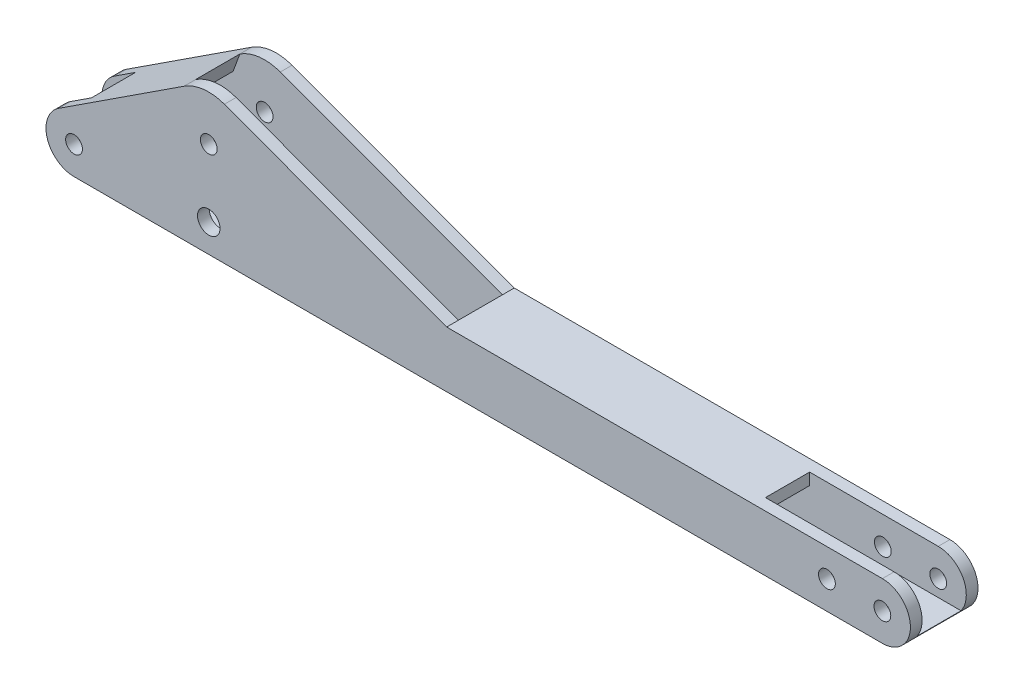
ISO-10303-21;
HEADER;
FILE_DESCRIPTION(('STEP AP214'),'2;1');
FILE_NAME('part.step','',(''),(''),'','','');
FILE_SCHEMA(('AUTOMOTIVE_DESIGN { 1 0 10303 214 1 1 1 1 }'));
ENDSEC;
DATA;
#1=APPLICATION_CONTEXT('core data for automotive mechanical design processes');
#2=APPLICATION_PROTOCOL_DEFINITION('international standard','automotive_design',2000,#1);
#3=PRODUCT_CONTEXT('',#1,'mechanical');
#4=PRODUCT('Part','Part','',(#3));
#5=PRODUCT_RELATED_PRODUCT_CATEGORY('part','',(#4));
#6=PRODUCT_DEFINITION_FORMATION('','',#4);
#7=PRODUCT_DEFINITION_CONTEXT('part definition',#1,'design');
#8=PRODUCT_DEFINITION('design','',#6,#7);
#9=PRODUCT_DEFINITION_SHAPE('','',#8);
#10=(LENGTH_UNIT() NAMED_UNIT(*) SI_UNIT(.MILLI.,.METRE.));
#11=(NAMED_UNIT(*) PLANE_ANGLE_UNIT() SI_UNIT($,.RADIAN.));
#12=(NAMED_UNIT(*) SI_UNIT($,.STERADIAN.) SOLID_ANGLE_UNIT());
#13=UNCERTAINTY_MEASURE_WITH_UNIT(LENGTH_MEASURE(1.E-05),#10,'distance_accuracy_value','');
#14=(GEOMETRIC_REPRESENTATION_CONTEXT(3) GLOBAL_UNCERTAINTY_ASSIGNED_CONTEXT((#13)) GLOBAL_UNIT_ASSIGNED_CONTEXT((#10,
#11,#12)) REPRESENTATION_CONTEXT('',''));
#15=CARTESIAN_POINT('',(0.,0.,0.));
#16=DIRECTION('',(0.,0.,1.));
#17=DIRECTION('',(1.,0.,0.));
#18=AXIS2_PLACEMENT_3D('',#15,#16,#17);
#19=CARTESIAN_POINT('',(169.675201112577,460.993549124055,153.));
#20=DIRECTION('',(-0.345410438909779,-0.938451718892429,0.));
#21=DIRECTION('',(0.938451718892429,-0.345410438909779,0.));
#22=AXIS2_PLACEMENT_3D('',#19,#20,#21);
#23=PLANE('',#22);
#24=DIRECTION('',(-0.938451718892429,0.345410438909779,0.));
#25=VECTOR('',#24,1.);
#26=CARTESIAN_POINT('',(169.675201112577,460.993549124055,-100.));
#27=LINE('',#26,#25);
#28=CARTESIAN_POINT('',(1077.10817060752,127.,-100.));
#29=VERTEX_POINT('',#28);
#30=CARTESIAN_POINT('',(70.8091399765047,497.382602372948,-100.));
#31=VERTEX_POINT('',#30);
#32=EDGE_CURVE('E222',#29,#31,#27,.T.);
#33=ORIENTED_EDGE('',*,*,#32,.F.);
#34=DIRECTION('',(0.,0.,-1.));
#35=VECTOR('',#34,1.);
#36=CARTESIAN_POINT('',(1077.10817060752,127.,153.));
#37=LINE('',#36,#35);
#38=CARTESIAN_POINT('',(1077.10817060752,127.,-153.));
#39=VERTEX_POINT('',#38);
#40=EDGE_CURVE('E360',#29,#39,#37,.T.);
#41=ORIENTED_EDGE('',*,*,#40,.T.);
#42=DIRECTION('',(-0.938451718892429,0.345410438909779,0.));
#43=VECTOR('',#42,1.);
#44=CARTESIAN_POINT('',(169.675201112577,460.993549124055,-153.));
#45=LINE('',#44,#43);
#46=CARTESIAN_POINT('',(70.8091399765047,497.382602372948,-153.));
#47=VERTEX_POINT('',#46);
#48=EDGE_CURVE('E327',#39,#47,#45,.T.);
#49=ORIENTED_EDGE('',*,*,#48,.T.);
#50=DIRECTION('',(0.,0.,-1.));
#51=VECTOR('',#50,1.);
#52=CARTESIAN_POINT('',(70.8091399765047,497.382602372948,153.));
#53=LINE('',#52,#51);
#54=EDGE_CURVE('E44',#31,#47,#53,.T.);
#55=ORIENTED_EDGE('',*,*,#54,.F.);
#56=EDGE_LOOP('',(#33,#41,#49,#55));
#57=FACE_BOUND('',#56,.T.);
#58=ADVANCED_FACE('F35',(#57),#23,.F.);
#59=CARTESIAN_POINT('',(0.,305.,153.));
#60=DIRECTION('',(0.,0.,-1.));
#61=DIRECTION('',(-1.,0.,0.));
#62=AXIS2_PLACEMENT_3D('',#59,#60,#61);
#63=CYLINDRICAL_SURFACE('',#62,205.);
#64=CARTESIAN_POINT('',(0.,305.,-100.));
#65=DIRECTION('',(0.,0.,1.));
#66=DIRECTION('',(1.,0.,0.));
#67=AXIS2_PLACEMENT_3D('',#64,#65,#66);
#68=CIRCLE('',#67,205.);
#69=CARTESIAN_POINT('',(-112.047709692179,476.669189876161,-100.));
#70=VERTEX_POINT('',#69);
#71=EDGE_CURVE('E224',#31,#70,#68,.T.);
#72=ORIENTED_EDGE('',*,*,#71,.F.);
#73=ORIENTED_EDGE('',*,*,#54,.T.);
#74=CARTESIAN_POINT('',(0.,305.,-153.));
#75=DIRECTION('',(0.,0.,1.));
#76=DIRECTION('',(1.,0.,0.));
#77=AXIS2_PLACEMENT_3D('',#74,#75,#76);
#78=CIRCLE('',#77,205.);
#79=CARTESIAN_POINT('',(-112.047709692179,476.669189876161,-153.));
#80=VERTEX_POINT('',#79);
#81=EDGE_CURVE('E363',#47,#80,#78,.T.);
#82=ORIENTED_EDGE('',*,*,#81,.T.);
#83=DIRECTION('',(0.,0.,-1.));
#84=VECTOR('',#83,1.);
#85=CARTESIAN_POINT('',(-112.047709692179,476.669189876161,153.));
#86=LINE('',#85,#84);
#87=EDGE_CURVE('E410',#70,#80,#86,.T.);
#88=ORIENTED_EDGE('',*,*,#87,.F.);
#89=EDGE_LOOP('',(#72,#73,#82,#88));
#90=FACE_BOUND('',#89,.T.);
#91=ADVANCED_FACE('F439',(#90),#63,.T.);
#92=CARTESIAN_POINT('',(-251.64836556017,385.55246839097,153.));
#93=DIRECTION('',(-0.546574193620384,0.837410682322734,0.));
#94=DIRECTION('',(-0.837410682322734,-0.546574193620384,0.));
#95=AXIS2_PLACEMENT_3D('',#92,#93,#94);
#96=PLANE('',#95);
#97=DIRECTION('',(0.,0.,-1.));
#98=VECTOR('',#97,1.);
#99=CARTESIAN_POINT('',(-679.414922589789,106.351156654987,153.));
#100=LINE('',#99,#98);
#101=CARTESIAN_POINT('',(-679.414922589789,106.351156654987,-100.));
#102=VERTEX_POINT('',#101);
#103=CARTESIAN_POINT('',(-679.414922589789,106.351156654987,-153.));
#104=VERTEX_POINT('',#103);
#105=EDGE_CURVE('E406',#102,#104,#100,.T.);
#106=ORIENTED_EDGE('',*,*,#105,.F.);
#107=DIRECTION('',(-0.837410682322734,-0.546574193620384,0.));
#108=VECTOR('',#107,1.);
#109=CARTESIAN_POINT('',(-251.64836556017,385.55246839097,-100.));
#110=LINE('',#109,#108);
#111=CARTESIAN_POINT('',(-584.5,168.301700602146,-100.));
#112=VERTEX_POINT('',#111);
#113=EDGE_CURVE('E236',#112,#102,#110,.T.);
#114=ORIENTED_EDGE('',*,*,#113,.F.);
#115=DIRECTION('',(0.,0.,1.));
#116=VECTOR('',#115,1.);
#117=CARTESIAN_POINT('',(-584.5,168.301700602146,-100.));
#118=LINE('',#117,#116);
#119=CARTESIAN_POINT('',(-584.5,168.301700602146,100.));
#120=VERTEX_POINT('',#119);
#121=EDGE_CURVE('E286',#112,#120,#118,.T.);
#122=ORIENTED_EDGE('',*,*,#121,.T.);
#123=DIRECTION('',(-0.837410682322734,-0.546574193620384,0.));
#124=VECTOR('',#123,1.);
#125=CARTESIAN_POINT('',(-251.64836556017,385.55246839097,100.));
#126=LINE('',#125,#124);
#127=CARTESIAN_POINT('',(-679.414922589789,106.351156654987,100.));
#128=VERTEX_POINT('',#127);
#129=EDGE_CURVE('E271',#120,#128,#126,.T.);
#130=ORIENTED_EDGE('',*,*,#129,.T.);
#131=CARTESIAN_POINT('',(-679.414922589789,106.351156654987,153.));
#132=VERTEX_POINT('',#131);
#133=EDGE_CURVE('E407',#132,#128,#100,.T.);
#134=ORIENTED_EDGE('',*,*,#133,.F.);
#135=DIRECTION('',(0.837410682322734,0.546574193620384,0.));
#136=VECTOR('',#135,1.);
#137=CARTESIAN_POINT('',(-251.64836556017,385.55246839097,153.));
#138=LINE('',#137,#136);
#139=CARTESIAN_POINT('',(-112.047709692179,476.669189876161,153.));
#140=VERTEX_POINT('',#139);
#141=EDGE_CURVE('E334',#132,#140,#138,.T.);
#142=ORIENTED_EDGE('',*,*,#141,.T.);
#143=CARTESIAN_POINT('',(-112.047709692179,476.669189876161,100.));
#144=VERTEX_POINT('',#143);
#145=EDGE_CURVE('E411',#140,#144,#86,.T.);
#146=ORIENTED_EDGE('',*,*,#145,.T.);
#147=DIRECTION('',(0.,0.,1.));
#148=VECTOR('',#147,1.);
#149=CARTESIAN_POINT('',(-112.047709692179,476.669189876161,-100.));
#150=LINE('',#149,#148);
#151=EDGE_CURVE('E293',#70,#144,#150,.T.);
#152=ORIENTED_EDGE('',*,*,#151,.F.);
#153=ORIENTED_EDGE('',*,*,#87,.T.);
#154=DIRECTION('',(0.837410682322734,0.546574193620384,0.));
#155=VECTOR('',#154,1.);
#156=CARTESIAN_POINT('',(-251.64836556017,385.55246839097,-153.));
#157=LINE('',#156,#155);
#158=EDGE_CURVE('E366',#104,#80,#157,.T.);
#159=ORIENTED_EDGE('',*,*,#158,.F.);
#160=EDGE_LOOP('',(#106,#114,#122,#130,#134,#142,#146,#152,#153,#159));
#161=FACE_BOUND('',#160,.T.);
#162=ADVANCED_FACE('F444',(#161),#96,.T.);
#163=CARTESIAN_POINT('',(-610.,0.,153.));
#164=DIRECTION('',(0.,0.,-1.));
#165=DIRECTION('',(-1.,0.,0.));
#166=AXIS2_PLACEMENT_3D('',#163,#164,#165);
#167=CYLINDRICAL_SURFACE('',#166,127.);
#168=CARTESIAN_POINT('',(-610.,0.,-100.));
#169=DIRECTION('',(0.,0.,1.));
#170=DIRECTION('',(1.,0.,0.));
#171=AXIS2_PLACEMENT_3D('',#168,#169,#170);
#172=CIRCLE('',#171,127.);
#173=CARTESIAN_POINT('',(-610.,-127.,-100.));
#174=VERTEX_POINT('',#173);
#175=EDGE_CURVE('E238',#102,#174,#172,.T.);
#176=ORIENTED_EDGE('',*,*,#175,.F.);
#177=ORIENTED_EDGE('',*,*,#105,.T.);
#178=CARTESIAN_POINT('',(-610.,0.,-153.));
#179=DIRECTION('',(0.,0.,1.));
#180=DIRECTION('',(1.,0.,0.));
#181=AXIS2_PLACEMENT_3D('',#178,#179,#180);
#182=CIRCLE('',#181,127.);
#183=CARTESIAN_POINT('',(-610.,-127.,-153.));
#184=VERTEX_POINT('',#183);
#185=EDGE_CURVE('E369',#104,#184,#182,.T.);
#186=ORIENTED_EDGE('',*,*,#185,.T.);
#187=DIRECTION('',(0.,0.,-1.));
#188=VECTOR('',#187,1.);
#189=CARTESIAN_POINT('',(-610.,-127.,153.));
#190=LINE('',#189,#188);
#191=EDGE_CURVE('E402',#174,#184,#190,.T.);
#192=ORIENTED_EDGE('',*,*,#191,.F.);
#193=EDGE_LOOP('',(#176,#177,#186,#192));
#194=FACE_BOUND('',#193,.T.);
#195=ADVANCED_FACE('F604',(#194),#167,.T.);
#196=CARTESIAN_POINT('',(0.,-127.,153.));
#197=DIRECTION('',(0.,1.,0.));
#198=DIRECTION('',(-1.,0.,0.));
#199=AXIS2_PLACEMENT_3D('',#196,#197,#198);
#200=PLANE('',#199);
#201=DIRECTION('',(1.,0.,0.));
#202=VECTOR('',#201,1.);
#203=CARTESIAN_POINT('',(0.,-127.,-100.));
#204=LINE('',#203,#202);
#205=CARTESIAN_POINT('',(-391.824965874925,-127.,-100.));
#206=VERTEX_POINT('',#205);
#207=EDGE_CURVE('E240',#174,#206,#204,.T.);
#208=ORIENTED_EDGE('',*,*,#207,.F.);
#209=ORIENTED_EDGE('',*,*,#191,.T.);
#210=DIRECTION('',(1.,0.,0.));
#211=VECTOR('',#210,1.);
#212=CARTESIAN_POINT('',(0.,-127.,-153.));
#213=LINE('',#212,#211);
#214=CARTESIAN_POINT('',(3050.,-127.,-153.));
#215=VERTEX_POINT('',#214);
#216=EDGE_CURVE('E372',#184,#215,#213,.T.);
#217=ORIENTED_EDGE('',*,*,#216,.T.);
#218=DIRECTION('',(0.,0.,-1.));
#219=VECTOR('',#218,1.);
#220=CARTESIAN_POINT('',(3050.,-127.,153.));
#221=LINE('',#220,#219);
#222=CARTESIAN_POINT('',(3050.,-127.,153.));
#223=VERTEX_POINT('',#222);
#224=EDGE_CURVE('E399',#223,#215,#221,.T.);
#225=ORIENTED_EDGE('',*,*,#224,.F.);
#226=DIRECTION('',(1.,0.,0.));
#227=VECTOR('',#226,1.);
#228=CARTESIAN_POINT('',(0.,-127.,153.));
#229=LINE('',#228,#227);
#230=CARTESIAN_POINT('',(-610.,-127.,153.));
#231=VERTEX_POINT('',#230);
#232=EDGE_CURVE('E339',#231,#223,#229,.T.);
#233=ORIENTED_EDGE('',*,*,#232,.F.);
#234=CARTESIAN_POINT('',(-610.,-127.,100.));
#235=VERTEX_POINT('',#234);
#236=EDGE_CURVE('E403',#231,#235,#190,.T.);
#237=ORIENTED_EDGE('',*,*,#236,.T.);
#238=DIRECTION('',(1.,0.,0.));
#239=VECTOR('',#238,1.);
#240=CARTESIAN_POINT('',(0.,-127.,100.));
#241=LINE('',#240,#239);
#242=CARTESIAN_POINT('',(-391.824965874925,-127.,100.));
#243=VERTEX_POINT('',#242);
#244=EDGE_CURVE('E277',#235,#243,#241,.T.);
#245=ORIENTED_EDGE('',*,*,#244,.T.);
#246=DIRECTION('',(0.,0.,1.));
#247=VECTOR('',#246,1.);
#248=CARTESIAN_POINT('',(-391.824965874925,-127.,-100.));
#249=LINE('',#248,#247);
#250=EDGE_CURVE('E284',#206,#243,#249,.T.);
#251=ORIENTED_EDGE('',*,*,#250,.F.);
#252=EDGE_LOOP('',(#208,#209,#217,#225,#233,#237,#245,#251));
#253=FACE_BOUND('',#252,.T.);
#254=ADVANCED_FACE('F613',(#253),#200,.F.);
#255=CARTESIAN_POINT('',(3050.,0.,153.));
#256=DIRECTION('',(0.,0.,-1.));
#257=DIRECTION('',(-1.,0.,0.));
#258=AXIS2_PLACEMENT_3D('',#255,#256,#257);
#259=CYLINDRICAL_SURFACE('',#258,127.);
#260=CARTESIAN_POINT('',(3050.,0.,-100.));
#261=DIRECTION('',(0.,0.,1.));
#262=DIRECTION('',(1.,0.,0.));
#263=AXIS2_PLACEMENT_3D('',#260,#261,#262);
#264=CIRCLE('',#263,127.);
#265=CARTESIAN_POINT('',(3153.21337122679,-74.0000000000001,-100.));
#266=VERTEX_POINT('',#265);
#267=CARTESIAN_POINT('',(3050.,127.,-100.));
#268=VERTEX_POINT('',#267);
#269=EDGE_CURVE('E203',#266,#268,#264,.T.);
#270=ORIENTED_EDGE('',*,*,#269,.F.);
#271=DIRECTION('',(0.,0.,1.));
#272=VECTOR('',#271,1.);
#273=CARTESIAN_POINT('',(3153.21337122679,-74.0000000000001,-100.));
#274=LINE('',#273,#272);
#275=CARTESIAN_POINT('',(3153.21337122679,-74.0000000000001,100.));
#276=VERTEX_POINT('',#275);
#277=EDGE_CURVE('E188',#266,#276,#274,.T.);
#278=ORIENTED_EDGE('',*,*,#277,.T.);
#279=CARTESIAN_POINT('',(3050.,0.,100.));
#280=DIRECTION('',(0.,0.,1.));
#281=DIRECTION('',(1.,0.,0.));
#282=AXIS2_PLACEMENT_3D('',#279,#280,#281);
#283=CIRCLE('',#282,127.);
#284=CARTESIAN_POINT('',(3050.,127.,100.));
#285=VERTEX_POINT('',#284);
#286=EDGE_CURVE('E244',#276,#285,#283,.T.);
#287=ORIENTED_EDGE('',*,*,#286,.T.);
#288=DIRECTION('',(0.,0.,-1.));
#289=VECTOR('',#288,1.);
#290=CARTESIAN_POINT('',(3050.,127.,153.));
#291=LINE('',#290,#289);
#292=CARTESIAN_POINT('',(3050.,127.,153.));
#293=VERTEX_POINT('',#292);
#294=EDGE_CURVE('E396',#293,#285,#291,.T.);
#295=ORIENTED_EDGE('',*,*,#294,.F.);
#296=CARTESIAN_POINT('',(3050.,0.,153.));
#297=DIRECTION('',(0.,0.,1.));
#298=DIRECTION('',(1.,0.,0.));
#299=AXIS2_PLACEMENT_3D('',#296,#297,#298);
#300=CIRCLE('',#299,127.);
#301=EDGE_CURVE('E341',#223,#293,#300,.T.);
#302=ORIENTED_EDGE('',*,*,#301,.F.);
#303=ORIENTED_EDGE('',*,*,#224,.T.);
#304=CARTESIAN_POINT('',(3050.,0.,-153.));
#305=DIRECTION('',(0.,0.,1.));
#306=DIRECTION('',(1.,0.,0.));
#307=AXIS2_PLACEMENT_3D('',#304,#305,#306);
#308=CIRCLE('',#307,127.);
#309=CARTESIAN_POINT('',(3050.,127.,-153.));
#310=VERTEX_POINT('',#309);
#311=EDGE_CURVE('E374',#215,#310,#308,.T.);
#312=ORIENTED_EDGE('',*,*,#311,.T.);
#313=EDGE_CURVE('E210',#268,#310,#291,.T.);
#314=ORIENTED_EDGE('',*,*,#313,.F.);
#315=EDGE_LOOP('',(#270,#278,#287,#295,#302,#303,#312,#314));
#316=FACE_BOUND('',#315,.T.);
#317=ADVANCED_FACE('F208',(#316),#259,.T.);
#318=CARTESIAN_POINT('',(-610.,0.,153.));
#319=DIRECTION('',(0.,0.,-1.));
#320=DIRECTION('',(-1.,0.,0.));
#321=AXIS2_PLACEMENT_3D('',#318,#319,#320);
#322=CYLINDRICAL_SURFACE('',#321,38.);
#323=CARTESIAN_POINT('',(-610.,0.,-153.));
#324=DIRECTION('',(0.,0.,1.));
#325=DIRECTION('',(1.,0.,0.));
#326=AXIS2_PLACEMENT_3D('',#323,#324,#325);
#327=CIRCLE('',#326,38.);
#328=CARTESIAN_POINT('',(-572.,0.,-153.));
#329=VERTEX_POINT('',#328);
#330=EDGE_CURVE('E388',#329,#329,#327,.T.);
#331=ORIENTED_EDGE('',*,*,#330,.F.);
#332=EDGE_LOOP('',(#331));
#333=FACE_BOUND('',#332,.T.);
#334=CARTESIAN_POINT('',(-610.,0.,-100.));
#335=DIRECTION('',(0.,0.,1.));
#336=DIRECTION('',(1.,0.,0.));
#337=AXIS2_PLACEMENT_3D('',#334,#335,#336);
#338=CIRCLE('',#337,38.);
#339=CARTESIAN_POINT('',(-572.,0.,-100.));
#340=VERTEX_POINT('',#339);
#341=EDGE_CURVE('E324',#340,#340,#338,.T.);
#342=ORIENTED_EDGE('',*,*,#341,.T.);
#343=EDGE_LOOP('',(#342));
#344=FACE_BOUND('',#343,.T.);
#345=ADVANCED_FACE('F594',(#333,#344),#322,.F.);
#346=CARTESIAN_POINT('',(3050.,0.,153.));
#347=DIRECTION('',(0.,0.,-1.));
#348=DIRECTION('',(-1.,0.,0.));
#349=AXIS2_PLACEMENT_3D('',#346,#347,#348);
#350=CYLINDRICAL_SURFACE('',#349,37.9999999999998);
#351=CARTESIAN_POINT('',(3050.,0.,-153.));
#352=DIRECTION('',(0.,0.,1.));
#353=DIRECTION('',(1.,0.,0.));
#354=AXIS2_PLACEMENT_3D('',#351,#352,#353);
#355=CIRCLE('',#354,37.9999999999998);
#356=CARTESIAN_POINT('',(3088.,0.,-153.));
#357=VERTEX_POINT('',#356);
#358=EDGE_CURVE('E385',#357,#357,#355,.T.);
#359=ORIENTED_EDGE('',*,*,#358,.F.);
#360=EDGE_LOOP('',(#359));
#361=FACE_BOUND('',#360,.T.);
#362=CARTESIAN_POINT('',(3050.,0.,-100.));
#363=DIRECTION('',(0.,0.,1.));
#364=DIRECTION('',(1.,0.,0.));
#365=AXIS2_PLACEMENT_3D('',#362,#363,#364);
#366=CIRCLE('',#365,37.9999999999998);
#367=CARTESIAN_POINT('',(3088.,0.,-100.));
#368=VERTEX_POINT('',#367);
#369=EDGE_CURVE('E321',#368,#368,#366,.T.);
#370=ORIENTED_EDGE('',*,*,#369,.T.);
#371=EDGE_LOOP('',(#370));
#372=FACE_BOUND('',#371,.T.);
#373=ADVANCED_FACE('F601',(#361,#372),#350,.F.);
#374=CARTESIAN_POINT('',(2799.,0.,153.));
#375=DIRECTION('',(0.,0.,-1.));
#376=DIRECTION('',(-1.,0.,0.));
#377=AXIS2_PLACEMENT_3D('',#374,#375,#376);
#378=CYLINDRICAL_SURFACE('',#377,38.0000000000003);
#379=CARTESIAN_POINT('',(2799.,0.,-153.));
#380=DIRECTION('',(0.,0.,1.));
#381=DIRECTION('',(1.,0.,0.));
#382=AXIS2_PLACEMENT_3D('',#379,#380,#381);
#383=CIRCLE('',#382,38.0000000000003);
#384=CARTESIAN_POINT('',(2837.,0.,-153.));
#385=VERTEX_POINT('',#384);
#386=EDGE_CURVE('E382',#385,#385,#383,.T.);
#387=ORIENTED_EDGE('',*,*,#386,.F.);
#388=EDGE_LOOP('',(#387));
#389=FACE_BOUND('',#388,.T.);
#390=CARTESIAN_POINT('',(2799.,0.,-100.));
#391=DIRECTION('',(0.,0.,1.));
#392=DIRECTION('',(1.,0.,0.));
#393=AXIS2_PLACEMENT_3D('',#390,#391,#392);
#394=CIRCLE('',#393,38.0000000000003);
#395=CARTESIAN_POINT('',(2837.,0.,-100.));
#396=VERTEX_POINT('',#395);
#397=EDGE_CURVE('E318',#396,#396,#394,.T.);
#398=ORIENTED_EDGE('',*,*,#397,.T.);
#399=EDGE_LOOP('',(#398));
#400=FACE_BOUND('',#399,.T.);
#401=ADVANCED_FACE('F611',(#389,#400),#378,.F.);
#402=CARTESIAN_POINT('',(0.,0.,153.));
#403=DIRECTION('',(0.,0.,-1.));
#404=DIRECTION('',(-1.,0.,0.));
#405=AXIS2_PLACEMENT_3D('',#402,#403,#404);
#406=CYLINDRICAL_SURFACE('',#405,51.);
#407=CARTESIAN_POINT('',(0.,0.,-153.));
#408=DIRECTION('',(0.,0.,1.));
#409=DIRECTION('',(1.,0.,0.));
#410=AXIS2_PLACEMENT_3D('',#407,#408,#409);
#411=CIRCLE('',#410,51.);
#412=CARTESIAN_POINT('',(51.,0.,-153.));
#413=VERTEX_POINT('',#412);
#414=EDGE_CURVE('E379',#413,#413,#411,.T.);
#415=ORIENTED_EDGE('',*,*,#414,.F.);
#416=EDGE_LOOP('',(#415));
#417=FACE_BOUND('',#416,.T.);
#418=CARTESIAN_POINT('',(0.,0.,-100.));
#419=DIRECTION('',(0.,0.,1.));
#420=DIRECTION('',(1.,0.,0.));
#421=AXIS2_PLACEMENT_3D('',#418,#419,#420);
#422=CIRCLE('',#421,51.);
#423=CARTESIAN_POINT('',(51.,0.,-100.));
#424=VERTEX_POINT('',#423);
#425=EDGE_CURVE('E315',#424,#424,#422,.T.);
#426=ORIENTED_EDGE('',*,*,#425,.T.);
#427=EDGE_LOOP('',(#426));
#428=FACE_BOUND('',#427,.T.);
#429=ADVANCED_FACE('F580',(#417,#428),#406,.F.);
#430=CARTESIAN_POINT('',(0.,127.,153.));
#431=DIRECTION('',(0.,-1.,0.));
#432=DIRECTION('',(1.,0.,0.));
#433=AXIS2_PLACEMENT_3D('',#430,#431,#432);
#434=PLANE('',#433);
#435=DIRECTION('',(-1.,0.,0.));
#436=VECTOR('',#435,1.);
#437=CARTESIAN_POINT('',(0.,127.,-100.));
#438=LINE('',#437,#436);
#439=CARTESIAN_POINT('',(2467.60077039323,127.,-100.));
#440=VERTEX_POINT('',#439);
#441=EDGE_CURVE('E211',#268,#440,#438,.T.);
#442=ORIENTED_EDGE('',*,*,#441,.F.);
#443=ORIENTED_EDGE('',*,*,#313,.T.);
#444=DIRECTION('',(-1.,0.,0.));
#445=VECTOR('',#444,1.);
#446=CARTESIAN_POINT('',(0.,127.,-153.));
#447=LINE('',#446,#445);
#448=EDGE_CURVE('E376',#310,#39,#447,.T.);
#449=ORIENTED_EDGE('',*,*,#448,.T.);
#450=ORIENTED_EDGE('',*,*,#40,.F.);
#451=DIRECTION('',(0.,0.,1.));
#452=VECTOR('',#451,1.);
#453=CARTESIAN_POINT('',(1077.10817060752,127.,-100.));
#454=LINE('',#453,#452);
#455=CARTESIAN_POINT('',(1077.10817060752,127.,100.));
#456=VERTEX_POINT('',#455);
#457=EDGE_CURVE('E295',#29,#456,#454,.T.);
#458=ORIENTED_EDGE('',*,*,#457,.T.);
#459=CARTESIAN_POINT('',(1077.10817060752,127.,153.));
#460=VERTEX_POINT('',#459);
#461=EDGE_CURVE('E393',#460,#456,#37,.T.);
#462=ORIENTED_EDGE('',*,*,#461,.F.);
#463=DIRECTION('',(-1.,0.,0.));
#464=VECTOR('',#463,1.);
#465=CARTESIAN_POINT('',(0.,127.,153.));
#466=LINE('',#465,#464);
#467=EDGE_CURVE('E343',#293,#460,#466,.T.);
#468=ORIENTED_EDGE('',*,*,#467,.F.);
#469=ORIENTED_EDGE('',*,*,#294,.T.);
#470=DIRECTION('',(-1.,0.,0.));
#471=VECTOR('',#470,1.);
#472=CARTESIAN_POINT('',(0.,127.,100.));
#473=LINE('',#472,#471);
#474=CARTESIAN_POINT('',(2467.60077039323,127.,100.));
#475=VERTEX_POINT('',#474);
#476=EDGE_CURVE('E246',#285,#475,#473,.T.);
#477=ORIENTED_EDGE('',*,*,#476,.T.);
#478=DIRECTION('',(0.,0.,1.));
#479=VECTOR('',#478,1.);
#480=CARTESIAN_POINT('',(2467.60077039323,127.,-100.));
#481=LINE('',#480,#479);
#482=EDGE_CURVE('E196',#440,#475,#481,.T.);
#483=ORIENTED_EDGE('',*,*,#482,.F.);
#484=EDGE_LOOP('',(#442,#443,#449,#450,#458,#462,#468,#469,#477,#483));
#485=FACE_BOUND('',#484,.T.);
#486=ADVANCED_FACE('F456',(#485),#434,.F.);
#487=CARTESIAN_POINT('',(0.,305.,153.));
#488=DIRECTION('',(0.,0.,-1.));
#489=DIRECTION('',(-1.,0.,0.));
#490=AXIS2_PLACEMENT_3D('',#487,#488,#489);
#491=CYLINDRICAL_SURFACE('',#490,38.);
#492=CARTESIAN_POINT('',(0.,305.,-153.));
#493=DIRECTION('',(0.,0.,1.));
#494=DIRECTION('',(1.,0.,0.));
#495=AXIS2_PLACEMENT_3D('',#492,#493,#494);
#496=CIRCLE('',#495,38.);
#497=CARTESIAN_POINT('',(38.,305.,-153.));
#498=VERTEX_POINT('',#497);
#499=EDGE_CURVE('E332',#498,#498,#496,.T.);
#500=ORIENTED_EDGE('',*,*,#499,.F.);
#501=EDGE_LOOP('',(#500));
#502=FACE_BOUND('',#501,.T.);
#503=CARTESIAN_POINT('',(0.,305.,-100.));
#504=DIRECTION('',(0.,0.,1.));
#505=DIRECTION('',(1.,0.,0.));
#506=AXIS2_PLACEMENT_3D('',#503,#504,#505);
#507=CIRCLE('',#506,38.);
#508=CARTESIAN_POINT('',(38.,305.,-100.));
#509=VERTEX_POINT('',#508);
#510=EDGE_CURVE('E39',#509,#509,#507,.T.);
#511=ORIENTED_EDGE('',*,*,#510,.T.);
#512=EDGE_LOOP('',(#511));
#513=FACE_BOUND('',#512,.T.);
#514=ADVANCED_FACE('F424',(#502,#513),#491,.F.);
#515=ORIENTED_EDGE('',*,*,#461,.T.);
#516=DIRECTION('',(-0.938451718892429,0.345410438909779,0.));
#517=VECTOR('',#516,1.);
#518=CARTESIAN_POINT('',(169.675201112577,460.993549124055,100.));
#519=LINE('',#518,#517);
#520=CARTESIAN_POINT('',(70.8091399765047,497.382602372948,100.));
#521=VERTEX_POINT('',#520);
#522=EDGE_CURVE('E256',#456,#521,#519,.T.);
#523=ORIENTED_EDGE('',*,*,#522,.T.);
#524=CARTESIAN_POINT('',(70.8091399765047,497.382602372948,153.));
#525=VERTEX_POINT('',#524);
#526=EDGE_CURVE('E11',#525,#521,#53,.T.);
#527=ORIENTED_EDGE('',*,*,#526,.F.);
#528=DIRECTION('',(-0.938451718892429,0.345410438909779,0.));
#529=VECTOR('',#528,1.);
#530=CARTESIAN_POINT('',(169.675201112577,460.993549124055,153.));
#531=LINE('',#530,#529);
#532=EDGE_CURVE('E328',#460,#525,#531,.T.);
#533=ORIENTED_EDGE('',*,*,#532,.F.);
#534=EDGE_LOOP('',(#515,#523,#527,#533));
#535=FACE_BOUND('',#534,.T.);
#536=ADVANCED_FACE('F37',(#535),#23,.F.);
#537=ORIENTED_EDGE('',*,*,#526,.T.);
#538=CARTESIAN_POINT('',(0.,305.,100.));
#539=DIRECTION('',(0.,0.,1.));
#540=DIRECTION('',(1.,0.,0.));
#541=AXIS2_PLACEMENT_3D('',#538,#539,#540);
#542=CIRCLE('',#541,205.);
#543=EDGE_CURVE('E259',#521,#144,#542,.T.);
#544=ORIENTED_EDGE('',*,*,#543,.T.);
#545=ORIENTED_EDGE('',*,*,#145,.F.);
#546=CARTESIAN_POINT('',(0.,305.,153.));
#547=DIRECTION('',(0.,0.,1.));
#548=DIRECTION('',(1.,0.,0.));
#549=AXIS2_PLACEMENT_3D('',#546,#547,#548);
#550=CIRCLE('',#549,205.);
#551=EDGE_CURVE('E331',#525,#140,#550,.T.);
#552=ORIENTED_EDGE('',*,*,#551,.F.);
#553=EDGE_LOOP('',(#537,#544,#545,#552));
#554=FACE_BOUND('',#553,.T.);
#555=ADVANCED_FACE('F446',(#554),#63,.T.);
#556=ORIENTED_EDGE('',*,*,#133,.T.);
#557=CARTESIAN_POINT('',(-610.,0.,100.));
#558=DIRECTION('',(0.,0.,1.));
#559=DIRECTION('',(1.,0.,0.));
#560=AXIS2_PLACEMENT_3D('',#557,#558,#559);
#561=CIRCLE('',#560,127.);
#562=EDGE_CURVE('E274',#128,#235,#561,.T.);
#563=ORIENTED_EDGE('',*,*,#562,.T.);
#564=ORIENTED_EDGE('',*,*,#236,.F.);
#565=CARTESIAN_POINT('',(-610.,0.,153.));
#566=DIRECTION('',(0.,0.,1.));
#567=DIRECTION('',(1.,0.,0.));
#568=AXIS2_PLACEMENT_3D('',#565,#566,#567);
#569=CIRCLE('',#568,127.);
#570=EDGE_CURVE('E337',#132,#231,#569,.T.);
#571=ORIENTED_EDGE('',*,*,#570,.F.);
#572=EDGE_LOOP('',(#556,#563,#564,#571));
#573=FACE_BOUND('',#572,.T.);
#574=ADVANCED_FACE('F454',(#573),#167,.T.);
#575=CARTESIAN_POINT('',(-610.,0.,100.));
#576=DIRECTION('',(0.,0.,1.));
#577=DIRECTION('',(1.,0.,0.));
#578=AXIS2_PLACEMENT_3D('',#575,#576,#577);
#579=CIRCLE('',#578,38.);
#580=CARTESIAN_POINT('',(-572.,0.,100.));
#581=VERTEX_POINT('',#580);
#582=EDGE_CURVE('E312',#581,#581,#579,.T.);
#583=ORIENTED_EDGE('',*,*,#582,.F.);
#584=EDGE_LOOP('',(#583));
#585=FACE_BOUND('',#584,.T.);
#586=CARTESIAN_POINT('',(-610.,0.,153.));
#587=DIRECTION('',(0.,0.,1.));
#588=DIRECTION('',(1.,0.,0.));
#589=AXIS2_PLACEMENT_3D('',#586,#587,#588);
#590=CIRCLE('',#589,38.);
#591=CARTESIAN_POINT('',(-572.,0.,153.));
#592=VERTEX_POINT('',#591);
#593=EDGE_CURVE('E354',#592,#592,#590,.T.);
#594=ORIENTED_EDGE('',*,*,#593,.T.);
#595=EDGE_LOOP('',(#594));
#596=FACE_BOUND('',#595,.T.);
#597=ADVANCED_FACE('F589',(#585,#596),#322,.F.);
#598=CARTESIAN_POINT('',(3050.,0.,100.));
#599=DIRECTION('',(0.,0.,1.));
#600=DIRECTION('',(1.,0.,0.));
#601=AXIS2_PLACEMENT_3D('',#598,#599,#600);
#602=CIRCLE('',#601,37.9999999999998);
#603=CARTESIAN_POINT('',(3088.,0.,100.));
#604=VERTEX_POINT('',#603);
#605=EDGE_CURVE('E309',#604,#604,#602,.T.);
#606=ORIENTED_EDGE('',*,*,#605,.F.);
#607=EDGE_LOOP('',(#606));
#608=FACE_BOUND('',#607,.T.);
#609=CARTESIAN_POINT('',(3050.,0.,153.));
#610=DIRECTION('',(0.,0.,1.));
#611=DIRECTION('',(1.,0.,0.));
#612=AXIS2_PLACEMENT_3D('',#609,#610,#611);
#613=CIRCLE('',#612,37.9999999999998);
#614=CARTESIAN_POINT('',(3088.,0.,153.));
#615=VERTEX_POINT('',#614);
#616=EDGE_CURVE('E351',#615,#615,#613,.T.);
#617=ORIENTED_EDGE('',*,*,#616,.T.);
#618=EDGE_LOOP('',(#617));
#619=FACE_BOUND('',#618,.T.);
#620=ADVANCED_FACE('F591',(#608,#619),#350,.F.);
#621=CARTESIAN_POINT('',(2799.,0.,100.));
#622=DIRECTION('',(0.,0.,1.));
#623=DIRECTION('',(1.,0.,0.));
#624=AXIS2_PLACEMENT_3D('',#621,#622,#623);
#625=CIRCLE('',#624,38.0000000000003);
#626=CARTESIAN_POINT('',(2837.,0.,100.));
#627=VERTEX_POINT('',#626);
#628=EDGE_CURVE('E306',#627,#627,#625,.T.);
#629=ORIENTED_EDGE('',*,*,#628,.F.);
#630=EDGE_LOOP('',(#629));
#631=FACE_BOUND('',#630,.T.);
#632=CARTESIAN_POINT('',(2799.,0.,153.));
#633=DIRECTION('',(0.,0.,1.));
#634=DIRECTION('',(1.,0.,0.));
#635=AXIS2_PLACEMENT_3D('',#632,#633,#634);
#636=CIRCLE('',#635,38.0000000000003);
#637=CARTESIAN_POINT('',(2837.,0.,153.));
#638=VERTEX_POINT('',#637);
#639=EDGE_CURVE('E348',#638,#638,#636,.T.);
#640=ORIENTED_EDGE('',*,*,#639,.T.);
#641=EDGE_LOOP('',(#640));
#642=FACE_BOUND('',#641,.T.);
#643=ADVANCED_FACE('F578',(#631,#642),#378,.F.);
#644=CARTESIAN_POINT('',(0.,0.,100.));
#645=DIRECTION('',(0.,0.,1.));
#646=DIRECTION('',(1.,0.,0.));
#647=AXIS2_PLACEMENT_3D('',#644,#645,#646);
#648=CIRCLE('',#647,51.);
#649=CARTESIAN_POINT('',(51.,0.,100.));
#650=VERTEX_POINT('',#649);
#651=EDGE_CURVE('E303',#650,#650,#648,.T.);
#652=ORIENTED_EDGE('',*,*,#651,.F.);
#653=EDGE_LOOP('',(#652));
#654=FACE_BOUND('',#653,.T.);
#655=CARTESIAN_POINT('',(0.,0.,153.));
#656=DIRECTION('',(0.,0.,1.));
#657=DIRECTION('',(1.,0.,0.));
#658=AXIS2_PLACEMENT_3D('',#655,#656,#657);
#659=CIRCLE('',#658,51.);
#660=CARTESIAN_POINT('',(51.,0.,153.));
#661=VERTEX_POINT('',#660);
#662=EDGE_CURVE('E345',#661,#661,#659,.T.);
#663=ORIENTED_EDGE('',*,*,#662,.T.);
#664=EDGE_LOOP('',(#663));
#665=FACE_BOUND('',#664,.T.);
#666=ADVANCED_FACE('F422',(#654,#665),#406,.F.);
#667=CARTESIAN_POINT('',(0.,305.,100.));
#668=DIRECTION('',(0.,0.,1.));
#669=DIRECTION('',(1.,0.,0.));
#670=AXIS2_PLACEMENT_3D('',#667,#668,#669);
#671=CIRCLE('',#670,38.);
#672=CARTESIAN_POINT('',(38.,305.,100.));
#673=VERTEX_POINT('',#672);
#674=EDGE_CURVE('E283',#673,#673,#671,.T.);
#675=ORIENTED_EDGE('',*,*,#674,.F.);
#676=EDGE_LOOP('',(#675));
#677=FACE_BOUND('',#676,.T.);
#678=CARTESIAN_POINT('',(0.,305.,153.));
#679=DIRECTION('',(0.,0.,1.));
#680=DIRECTION('',(1.,0.,0.));
#681=AXIS2_PLACEMENT_3D('',#678,#679,#680);
#682=CIRCLE('',#681,38.);
#683=CARTESIAN_POINT('',(38.,305.,153.));
#684=VERTEX_POINT('',#683);
#685=EDGE_CURVE('E357',#684,#684,#682,.T.);
#686=ORIENTED_EDGE('',*,*,#685,.T.);
#687=EDGE_LOOP('',(#686));
#688=FACE_BOUND('',#687,.T.);
#689=ADVANCED_FACE('F418',(#677,#688),#491,.F.);
#690=CARTESIAN_POINT('',(0.,0.,153.));
#691=DIRECTION('',(0.,0.,1.));
#692=DIRECTION('',(1.,0.,0.));
#693=AXIS2_PLACEMENT_3D('',#690,#691,#692);
#694=PLANE('',#693);
#695=ORIENTED_EDGE('',*,*,#532,.T.);
#696=ORIENTED_EDGE('',*,*,#551,.T.);
#697=ORIENTED_EDGE('',*,*,#141,.F.);
#698=ORIENTED_EDGE('',*,*,#570,.T.);
#699=ORIENTED_EDGE('',*,*,#232,.T.);
#700=ORIENTED_EDGE('',*,*,#301,.T.);
#701=ORIENTED_EDGE('',*,*,#467,.T.);
#702=EDGE_LOOP('',(#695,#696,#697,#698,#699,#700,#701));
#703=FACE_BOUND('',#702,.T.);
#704=ORIENTED_EDGE('',*,*,#662,.F.);
#705=EDGE_LOOP('',(#704));
#706=FACE_BOUND('',#705,.T.);
#707=ORIENTED_EDGE('',*,*,#639,.F.);
#708=EDGE_LOOP('',(#707));
#709=FACE_BOUND('',#708,.T.);
#710=ORIENTED_EDGE('',*,*,#616,.F.);
#711=EDGE_LOOP('',(#710));
#712=FACE_BOUND('',#711,.T.);
#713=ORIENTED_EDGE('',*,*,#593,.F.);
#714=EDGE_LOOP('',(#713));
#715=FACE_BOUND('',#714,.T.);
#716=ORIENTED_EDGE('',*,*,#685,.F.);
#717=EDGE_LOOP('',(#716));
#718=FACE_BOUND('',#717,.T.);
#719=ADVANCED_FACE('F421',(#703,#706,#709,#712,#715,#718),#694,.T.);
#720=CARTESIAN_POINT('',(0.,0.,-153.));
#721=DIRECTION('',(0.,0.,1.));
#722=DIRECTION('',(1.,0.,0.));
#723=AXIS2_PLACEMENT_3D('',#720,#721,#722);
#724=PLANE('',#723);
#725=ORIENTED_EDGE('',*,*,#48,.F.);
#726=ORIENTED_EDGE('',*,*,#448,.F.);
#727=ORIENTED_EDGE('',*,*,#311,.F.);
#728=ORIENTED_EDGE('',*,*,#216,.F.);
#729=ORIENTED_EDGE('',*,*,#185,.F.);
#730=ORIENTED_EDGE('',*,*,#158,.T.);
#731=ORIENTED_EDGE('',*,*,#81,.F.);
#732=EDGE_LOOP('',(#725,#726,#727,#728,#729,#730,#731));
#733=FACE_BOUND('',#732,.T.);
#734=ORIENTED_EDGE('',*,*,#414,.T.);
#735=EDGE_LOOP('',(#734));
#736=FACE_BOUND('',#735,.T.);
#737=ORIENTED_EDGE('',*,*,#386,.T.);
#738=EDGE_LOOP('',(#737));
#739=FACE_BOUND('',#738,.T.);
#740=ORIENTED_EDGE('',*,*,#358,.T.);
#741=EDGE_LOOP('',(#740));
#742=FACE_BOUND('',#741,.T.);
#743=ORIENTED_EDGE('',*,*,#330,.T.);
#744=EDGE_LOOP('',(#743));
#745=FACE_BOUND('',#744,.T.);
#746=ORIENTED_EDGE('',*,*,#499,.T.);
#747=EDGE_LOOP('',(#746));
#748=FACE_BOUND('',#747,.T.);
#749=ADVANCED_FACE('F428',(#733,#736,#739,#742,#745,#748),#724,.F.);
#750=CARTESIAN_POINT('',(0.,-74.0000000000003,-100.));
#751=DIRECTION('',(0.,-1.,0.));
#752=DIRECTION('',(1.,0.,0.));
#753=AXIS2_PLACEMENT_3D('',#750,#751,#752);
#754=PLANE('',#753);
#755=DIRECTION('',(1.,0.,0.));
#756=VECTOR('',#755,1.);
#757=CARTESIAN_POINT('',(0.,-74.0000000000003,100.));
#758=LINE('',#757,#756);
#759=CARTESIAN_POINT('',(-310.623243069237,-74.0000000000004,100.));
#760=VERTEX_POINT('',#759);
#761=EDGE_CURVE('E192',#760,#276,#758,.T.);
#762=ORIENTED_EDGE('',*,*,#761,.T.);
#763=ORIENTED_EDGE('',*,*,#277,.F.);
#764=DIRECTION('',(1.,0.,0.));
#765=VECTOR('',#764,1.);
#766=CARTESIAN_POINT('',(0.,-74.0000000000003,-100.));
#767=LINE('',#766,#765);
#768=CARTESIAN_POINT('',(-310.623243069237,-74.0000000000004,-100.));
#769=VERTEX_POINT('',#768);
#770=EDGE_CURVE('E191',#769,#266,#767,.T.);
#771=ORIENTED_EDGE('',*,*,#770,.F.);
#772=DIRECTION('',(0.,0.,1.));
#773=VECTOR('',#772,1.);
#774=CARTESIAN_POINT('',(-310.623243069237,-74.0000000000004,-100.));
#775=LINE('',#774,#773);
#776=EDGE_CURVE('E281',#769,#760,#775,.T.);
#777=ORIENTED_EDGE('',*,*,#776,.T.);
#778=EDGE_LOOP('',(#762,#763,#771,#777));
#779=FACE_BOUND('',#778,.T.);
#780=ADVANCED_FACE('F190',(#779),#754,.F.);
#781=CARTESIAN_POINT('',(-58.9263048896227,90.2814618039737,-100.));
#782=DIRECTION('',(-0.546574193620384,0.837410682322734,0.));
#783=DIRECTION('',(-0.837410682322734,-0.546574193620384,0.));
#784=AXIS2_PLACEMENT_3D('',#781,#782,#783);
#785=PLANE('',#784);
#786=DIRECTION('',(-0.837410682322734,-0.546574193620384,0.));
#787=VECTOR('',#786,1.);
#788=CARTESIAN_POINT('',(-58.9263048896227,90.2814618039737,100.));
#789=LINE('',#788,#787);
#790=EDGE_CURVE('E52',#760,#243,#789,.T.);
#791=ORIENTED_EDGE('',*,*,#790,.F.);
#792=ORIENTED_EDGE('',*,*,#776,.F.);
#793=DIRECTION('',(-0.837410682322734,-0.546574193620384,0.));
#794=VECTOR('',#793,1.);
#795=CARTESIAN_POINT('',(-58.9263048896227,90.2814618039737,-100.));
#796=LINE('',#795,#794);
#797=EDGE_CURVE('E197',#769,#206,#796,.T.);
#798=ORIENTED_EDGE('',*,*,#797,.T.);
#799=ORIENTED_EDGE('',*,*,#250,.T.);
#800=EDGE_LOOP('',(#791,#792,#798,#799));
#801=FACE_BOUND('',#800,.T.);
#802=ADVANCED_FACE('F511',(#801),#785,.T.);
#803=CARTESIAN_POINT('',(-332.85163443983,-217.250767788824,-100.));
#804=DIRECTION('',(0.837410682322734,0.546574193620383,0.));
#805=DIRECTION('',(-0.546574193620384,0.837410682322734,0.));
#806=AXIS2_PLACEMENT_3D('',#803,#804,#805);
#807=PLANE('',#806);
#808=DIRECTION('',(-0.546574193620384,0.837410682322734,0.));
#809=VECTOR('',#808,1.);
#810=CARTESIAN_POINT('',(-332.85163443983,-217.250767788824,100.));
#811=LINE('',#810,#809);
#812=CARTESIAN_POINT('',(-555.53156773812,123.918934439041,100.));
#813=VERTEX_POINT('',#812);
#814=EDGE_CURVE('E268',#813,#120,#811,.T.);
#815=ORIENTED_EDGE('',*,*,#814,.T.);
#816=ORIENTED_EDGE('',*,*,#121,.F.);
#817=DIRECTION('',(-0.546574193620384,0.837410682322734,0.));
#818=VECTOR('',#817,1.);
#819=CARTESIAN_POINT('',(-332.85163443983,-217.250767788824,-100.));
#820=LINE('',#819,#818);
#821=CARTESIAN_POINT('',(-555.53156773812,123.918934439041,-100.));
#822=VERTEX_POINT('',#821);
#823=EDGE_CURVE('E233',#822,#112,#820,.T.);
#824=ORIENTED_EDGE('',*,*,#823,.F.);
#825=DIRECTION('',(0.,0.,1.));
#826=VECTOR('',#825,1.);
#827=CARTESIAN_POINT('',(-555.53156773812,123.918934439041,-100.));
#828=LINE('',#827,#826);
#829=EDGE_CURVE('E289',#822,#813,#828,.T.);
#830=ORIENTED_EDGE('',*,*,#829,.T.);
#831=EDGE_LOOP('',(#815,#816,#824,#830));
#832=FACE_BOUND('',#831,.T.);
#833=ADVANCED_FACE('F515',(#832),#807,.F.);
#834=CARTESIAN_POINT('',(-222.67993329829,341.169702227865,-100.));
#835=DIRECTION('',(-0.546574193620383,0.837410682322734,0.));
#836=DIRECTION('',(-0.837410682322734,-0.546574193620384,0.));
#837=AXIS2_PLACEMENT_3D('',#834,#835,#836);
#838=PLANE('',#837);
#839=DIRECTION('',(-0.837410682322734,-0.546574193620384,0.));
#840=VECTOR('',#839,1.);
#841=CARTESIAN_POINT('',(-222.67993329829,341.169702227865,100.));
#842=LINE('',#841,#840);
#843=CARTESIAN_POINT('',(-142.708330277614,393.3668085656,100.));
#844=VERTEX_POINT('',#843);
#845=EDGE_CURVE('E265',#844,#813,#842,.T.);
#846=ORIENTED_EDGE('',*,*,#845,.T.);
#847=ORIENTED_EDGE('',*,*,#829,.F.);
#848=DIRECTION('',(-0.837410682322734,-0.546574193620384,0.));
#849=VECTOR('',#848,1.);
#850=CARTESIAN_POINT('',(-222.67993329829,341.169702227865,-100.));
#851=LINE('',#850,#849);
#852=CARTESIAN_POINT('',(-142.708330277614,393.3668085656,-100.));
#853=VERTEX_POINT('',#852);
#854=EDGE_CURVE('E230',#853,#822,#851,.T.);
#855=ORIENTED_EDGE('',*,*,#854,.F.);
#856=DIRECTION('',(0.,0.,1.));
#857=VECTOR('',#856,1.);
#858=CARTESIAN_POINT('',(-142.708330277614,393.3668085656,-100.));
#859=LINE('',#858,#857);
#860=EDGE_CURVE('E291',#853,#844,#859,.T.);
#861=ORIENTED_EDGE('',*,*,#860,.T.);
#862=EDGE_LOOP('',(#846,#847,#855,#861));
#863=FACE_BOUND('',#862,.T.);
#864=ADVANCED_FACE('F521',(#863),#838,.F.);
#865=CARTESIAN_POINT('',(-253.192284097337,93.1910040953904,-100.));
#866=DIRECTION('',(-0.938451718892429,0.345410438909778,0.));
#867=DIRECTION('',(-0.345410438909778,-0.938451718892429,0.));
#868=AXIS2_PLACEMENT_3D('',#865,#866,#867);
#869=PLANE('',#868);
#870=DIRECTION('',(-0.345410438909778,-0.938451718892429,0.));
#871=VECTOR('',#870,1.);
#872=CARTESIAN_POINT('',(-253.192284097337,93.1910040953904,100.));
#873=LINE('',#872,#871);
#874=EDGE_CURVE('E262',#144,#844,#873,.T.);
#875=ORIENTED_EDGE('',*,*,#874,.T.);
#876=ORIENTED_EDGE('',*,*,#860,.F.);
#877=DIRECTION('',(-0.345410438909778,-0.938451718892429,0.));
#878=VECTOR('',#877,1.);
#879=CARTESIAN_POINT('',(-253.192284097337,93.1910040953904,-100.));
#880=LINE('',#879,#878);
#881=EDGE_CURVE('E227',#70,#853,#880,.T.);
#882=ORIENTED_EDGE('',*,*,#881,.F.);
#883=ORIENTED_EDGE('',*,*,#151,.T.);
#884=EDGE_LOOP('',(#875,#876,#882,#883));
#885=FACE_BOUND('',#884,.T.);
#886=ADVANCED_FACE('F488',(#885),#869,.F.);
#887=CARTESIAN_POINT('',(907.432969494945,-333.993549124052,-100.));
#888=DIRECTION('',(-0.93845171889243,0.345410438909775,0.));
#889=DIRECTION('',(-0.345410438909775,-0.93845171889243,0.));
#890=AXIS2_PLACEMENT_3D('',#887,#888,#889);
#891=PLANE('',#890);
#892=DIRECTION('',(-0.345410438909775,-0.93845171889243,0.));
#893=VECTOR('',#892,1.);
#894=CARTESIAN_POINT('',(907.432969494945,-333.993549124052,100.));
#895=LINE('',#894,#893);
#896=CARTESIAN_POINT('',(1057.60077039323,74.,100.));
#897=VERTEX_POINT('',#896);
#898=EDGE_CURVE('E253',#456,#897,#895,.T.);
#899=ORIENTED_EDGE('',*,*,#898,.F.);
#900=ORIENTED_EDGE('',*,*,#457,.F.);
#901=DIRECTION('',(-0.345410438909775,-0.93845171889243,0.));
#902=VECTOR('',#901,1.);
#903=CARTESIAN_POINT('',(907.432969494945,-333.993549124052,-100.));
#904=LINE('',#903,#902);
#905=CARTESIAN_POINT('',(1057.60077039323,74.,-100.));
#906=VERTEX_POINT('',#905);
#907=EDGE_CURVE('E220',#29,#906,#904,.T.);
#908=ORIENTED_EDGE('',*,*,#907,.T.);
#909=DIRECTION('',(0.,0.,1.));
#910=VECTOR('',#909,1.);
#911=CARTESIAN_POINT('',(1057.60077039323,74.,-100.));
#912=LINE('',#911,#910);
#913=EDGE_CURVE('E298',#906,#897,#912,.T.);
#914=ORIENTED_EDGE('',*,*,#913,.T.);
#915=EDGE_LOOP('',(#899,#900,#908,#914));
#916=FACE_BOUND('',#915,.T.);
#917=ADVANCED_FACE('F467',(#916),#891,.T.);
#918=CARTESIAN_POINT('',(0.,73.9999999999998,-100.));
#919=DIRECTION('',(0.,1.,0.));
#920=DIRECTION('',(-1.,0.,0.));
#921=AXIS2_PLACEMENT_3D('',#918,#919,#920);
#922=PLANE('',#921);
#923=DIRECTION('',(-1.,0.,0.));
#924=VECTOR('',#923,1.);
#925=CARTESIAN_POINT('',(0.,73.9999999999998,100.));
#926=LINE('',#925,#924);
#927=CARTESIAN_POINT('',(2467.60077039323,74.0000000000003,100.));
#928=VERTEX_POINT('',#927);
#929=EDGE_CURVE('E250',#928,#897,#926,.T.);
#930=ORIENTED_EDGE('',*,*,#929,.T.);
#931=ORIENTED_EDGE('',*,*,#913,.F.);
#932=DIRECTION('',(-1.,0.,0.));
#933=VECTOR('',#932,1.);
#934=CARTESIAN_POINT('',(0.,73.9999999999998,-100.));
#935=LINE('',#934,#933);
#936=CARTESIAN_POINT('',(2467.60077039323,74.0000000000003,-100.));
#937=VERTEX_POINT('',#936);
#938=EDGE_CURVE('E217',#937,#906,#935,.T.);
#939=ORIENTED_EDGE('',*,*,#938,.F.);
#940=DIRECTION('',(0.,0.,1.));
#941=VECTOR('',#940,1.);
#942=CARTESIAN_POINT('',(2467.60077039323,74.0000000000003,-100.));
#943=LINE('',#942,#941);
#944=EDGE_CURVE('E300',#937,#928,#943,.T.);
#945=ORIENTED_EDGE('',*,*,#944,.T.);
#946=EDGE_LOOP('',(#930,#931,#939,#945));
#947=FACE_BOUND('',#946,.T.);
#948=ADVANCED_FACE('F500',(#947),#922,.F.);
#949=CARTESIAN_POINT('',(2467.60077039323,0.,-100.));
#950=DIRECTION('',(1.,0.,0.));
#951=DIRECTION('',(0.,0.,-1.));
#952=AXIS2_PLACEMENT_3D('',#949,#950,#951);
#953=PLANE('',#952);
#954=DIRECTION('',(0.,1.,0.));
#955=VECTOR('',#954,1.);
#956=CARTESIAN_POINT('',(2467.60077039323,0.,100.));
#957=LINE('',#956,#955);
#958=EDGE_CURVE('E59',#928,#475,#957,.T.);
#959=ORIENTED_EDGE('',*,*,#958,.F.);
#960=ORIENTED_EDGE('',*,*,#944,.F.);
#961=DIRECTION('',(0.,1.,0.));
#962=VECTOR('',#961,1.);
#963=CARTESIAN_POINT('',(2467.60077039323,0.,-100.));
#964=LINE('',#963,#962);
#965=EDGE_CURVE('E213',#937,#440,#964,.T.);
#966=ORIENTED_EDGE('',*,*,#965,.T.);
#967=ORIENTED_EDGE('',*,*,#482,.T.);
#968=EDGE_LOOP('',(#959,#960,#966,#967));
#969=FACE_BOUND('',#968,.T.);
#970=ADVANCED_FACE('F498',(#969),#953,.T.);
#971=CARTESIAN_POINT('',(0.,0.,-100.));
#972=DIRECTION('',(0.,0.,1.));
#973=DIRECTION('',(1.,0.,0.));
#974=AXIS2_PLACEMENT_3D('',#971,#972,#973);
#975=PLANE('',#974);
#976=ORIENTED_EDGE('',*,*,#341,.F.);
#977=EDGE_LOOP('',(#976));
#978=FACE_BOUND('',#977,.T.);
#979=ORIENTED_EDGE('',*,*,#369,.F.);
#980=EDGE_LOOP('',(#979));
#981=FACE_BOUND('',#980,.T.);
#982=ORIENTED_EDGE('',*,*,#397,.F.);
#983=EDGE_LOOP('',(#982));
#984=FACE_BOUND('',#983,.T.);
#985=ORIENTED_EDGE('',*,*,#425,.F.);
#986=EDGE_LOOP('',(#985));
#987=FACE_BOUND('',#986,.T.);
#988=ORIENTED_EDGE('',*,*,#510,.F.);
#989=EDGE_LOOP('',(#988));
#990=FACE_BOUND('',#989,.T.);
#991=ORIENTED_EDGE('',*,*,#770,.T.);
#992=ORIENTED_EDGE('',*,*,#269,.T.);
#993=ORIENTED_EDGE('',*,*,#441,.T.);
#994=ORIENTED_EDGE('',*,*,#965,.F.);
#995=ORIENTED_EDGE('',*,*,#938,.T.);
#996=ORIENTED_EDGE('',*,*,#907,.F.);
#997=ORIENTED_EDGE('',*,*,#32,.T.);
#998=ORIENTED_EDGE('',*,*,#71,.T.);
#999=ORIENTED_EDGE('',*,*,#881,.T.);
#1000=ORIENTED_EDGE('',*,*,#854,.T.);
#1001=ORIENTED_EDGE('',*,*,#823,.T.);
#1002=ORIENTED_EDGE('',*,*,#113,.T.);
#1003=ORIENTED_EDGE('',*,*,#175,.T.);
#1004=ORIENTED_EDGE('',*,*,#207,.T.);
#1005=ORIENTED_EDGE('',*,*,#797,.F.);
#1006=EDGE_LOOP('',(#991,#992,#993,#994,#995,#996,#997,#998,#999,#1000,#1001,#1002,#1003,#1004,#1005));
#1007=FACE_BOUND('',#1006,.T.);
#1008=ADVANCED_FACE('F201',(#978,#981,#984,#987,#990,#1007),#975,.T.);
#1009=CARTESIAN_POINT('',(0.,0.,100.));
#1010=DIRECTION('',(0.,0.,1.));
#1011=DIRECTION('',(1.,0.,0.));
#1012=AXIS2_PLACEMENT_3D('',#1009,#1010,#1011);
#1013=PLANE('',#1012);
#1014=ORIENTED_EDGE('',*,*,#582,.T.);
#1015=EDGE_LOOP('',(#1014));
#1016=FACE_BOUND('',#1015,.T.);
#1017=ORIENTED_EDGE('',*,*,#605,.T.);
#1018=EDGE_LOOP('',(#1017));
#1019=FACE_BOUND('',#1018,.T.);
#1020=ORIENTED_EDGE('',*,*,#628,.T.);
#1021=EDGE_LOOP('',(#1020));
#1022=FACE_BOUND('',#1021,.T.);
#1023=ORIENTED_EDGE('',*,*,#651,.T.);
#1024=EDGE_LOOP('',(#1023));
#1025=FACE_BOUND('',#1024,.T.);
#1026=ORIENTED_EDGE('',*,*,#674,.T.);
#1027=EDGE_LOOP('',(#1026));
#1028=FACE_BOUND('',#1027,.T.);
#1029=ORIENTED_EDGE('',*,*,#761,.F.);
#1030=ORIENTED_EDGE('',*,*,#790,.T.);
#1031=ORIENTED_EDGE('',*,*,#244,.F.);
#1032=ORIENTED_EDGE('',*,*,#562,.F.);
#1033=ORIENTED_EDGE('',*,*,#129,.F.);
#1034=ORIENTED_EDGE('',*,*,#814,.F.);
#1035=ORIENTED_EDGE('',*,*,#845,.F.);
#1036=ORIENTED_EDGE('',*,*,#874,.F.);
#1037=ORIENTED_EDGE('',*,*,#543,.F.);
#1038=ORIENTED_EDGE('',*,*,#522,.F.);
#1039=ORIENTED_EDGE('',*,*,#898,.T.);
#1040=ORIENTED_EDGE('',*,*,#929,.F.);
#1041=ORIENTED_EDGE('',*,*,#958,.T.);
#1042=ORIENTED_EDGE('',*,*,#476,.F.);
#1043=ORIENTED_EDGE('',*,*,#286,.F.);
#1044=EDGE_LOOP('',(#1029,#1030,#1031,#1032,#1033,#1034,#1035,#1036,#1037,#1038,#1039,#1040,
#1041,#1042,#1043));
#1045=FACE_BOUND('',#1044,.T.);
#1046=ADVANCED_FACE('F416',(#1016,#1019,#1022,#1025,#1028,#1045),#1013,.F.);
#1047=CLOSED_SHELL('',(#58,#91,#162,#195,#254,#317,#345,#373,#401,#429,#486,#514,#536,#555,#574,
#597,#620,#643,#666,#689,#719,#749,#780,#802,#833,#864,#886,#917,#948,#970,#1008,#1046));
#1048=MANIFOLD_SOLID_BREP('B2',#1047);
#1049=ADVANCED_BREP_SHAPE_REPRESENTATION('',(#18,#1048),#14);
#1050=SHAPE_DEFINITION_REPRESENTATION(#9,#1049);
ENDSEC;
END-ISO-10303-21;
